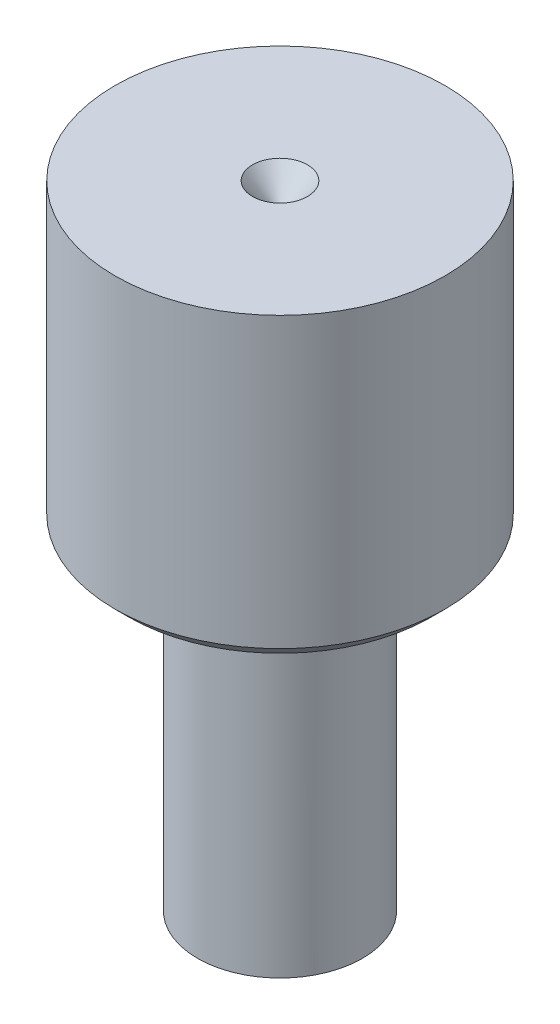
ISO-10303-21;
HEADER;
FILE_DESCRIPTION(('STEP AP214'),'2;1');
FILE_NAME('part.step','',(''),(''),'','','');
FILE_SCHEMA(('AUTOMOTIVE_DESIGN { 1 0 10303 214 1 1 1 1 }'));
ENDSEC;
DATA;
#1=APPLICATION_CONTEXT('core data for automotive mechanical design processes');
#2=APPLICATION_PROTOCOL_DEFINITION('international standard','automotive_design',2000,#1);
#3=PRODUCT_CONTEXT('',#1,'mechanical');
#4=PRODUCT('Part','Part','',(#3));
#5=PRODUCT_RELATED_PRODUCT_CATEGORY('part','',(#4));
#6=PRODUCT_DEFINITION_FORMATION('','',#4);
#7=PRODUCT_DEFINITION_CONTEXT('part definition',#1,'design');
#8=PRODUCT_DEFINITION('design','',#6,#7);
#9=PRODUCT_DEFINITION_SHAPE('','',#8);
#10=(LENGTH_UNIT() NAMED_UNIT(*) SI_UNIT(.MILLI.,.METRE.));
#11=(NAMED_UNIT(*) PLANE_ANGLE_UNIT() SI_UNIT($,.RADIAN.));
#12=(NAMED_UNIT(*) SI_UNIT($,.STERADIAN.) SOLID_ANGLE_UNIT());
#13=UNCERTAINTY_MEASURE_WITH_UNIT(LENGTH_MEASURE(1.E-05),#10,'distance_accuracy_value','');
#14=(GEOMETRIC_REPRESENTATION_CONTEXT(3) GLOBAL_UNCERTAINTY_ASSIGNED_CONTEXT((#13)) GLOBAL_UNIT_ASSIGNED_CONTEXT((#10,
#11,#12)) REPRESENTATION_CONTEXT('',''));
#15=CARTESIAN_POINT('',(0.,0.,0.));
#16=DIRECTION('',(0.,0.,1.));
#17=DIRECTION('',(1.,0.,0.));
#18=AXIS2_PLACEMENT_3D('',#15,#16,#17);
#19=CARTESIAN_POINT('',(0.,0.,0.));
#20=DIRECTION('',(0.,1.,0.));
#21=DIRECTION('',(0.,0.,1.));
#22=AXIS2_PLACEMENT_3D('',#19,#20,#21);
#23=PLANE('',#22);
#24=CARTESIAN_POINT('',(0.,0.,0.));
#25=DIRECTION('',(0.,1.,0.));
#26=DIRECTION('',(0.,0.,1.));
#27=AXIS2_PLACEMENT_3D('',#24,#25,#26);
#28=CIRCLE('',#27,3.4);
#29=CARTESIAN_POINT('',(0.,0.,3.4));
#30=VERTEX_POINT('',#29);
#31=EDGE_CURVE('E10',#30,#30,#28,.T.);
#32=ORIENTED_EDGE('',*,*,#31,.T.);
#33=EDGE_LOOP('',(#32));
#34=FACE_BOUND('',#33,.T.);
#35=CARTESIAN_POINT('',(0.,0.,0.));
#36=DIRECTION('',(0.,1.,0.));
#37=DIRECTION('',(0.,0.,1.));
#38=AXIS2_PLACEMENT_3D('',#35,#36,#37);
#39=CIRCLE('',#38,5.5);
#40=CARTESIAN_POINT('',(0.,0.,5.5));
#41=VERTEX_POINT('',#40);
#42=EDGE_CURVE('E41',#41,#41,#39,.F.);
#43=ORIENTED_EDGE('',*,*,#42,.T.);
#44=EDGE_LOOP('',(#43));
#45=FACE_BOUND('',#44,.T.);
#46=ADVANCED_FACE('F30',(#34,#45),#23,.F.);
#47=CARTESIAN_POINT('',(0.,11.,0.));
#48=DIRECTION('',(0.,-1.,0.));
#49=DIRECTION('',(0.,0.,-1.));
#50=AXIS2_PLACEMENT_3D('',#47,#48,#49);
#51=CYLINDRICAL_SURFACE('',#50,6.);
#52=CARTESIAN_POINT('',(0.,0.499999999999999,0.));
#53=DIRECTION('',(0.,1.,0.));
#54=DIRECTION('',(0.,0.,1.));
#55=AXIS2_PLACEMENT_3D('',#52,#53,#54);
#56=CIRCLE('',#55,6.);
#57=CARTESIAN_POINT('',(0.,0.499999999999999,6.));
#58=VERTEX_POINT('',#57);
#59=EDGE_CURVE('E45',#58,#58,#56,.T.);
#60=ORIENTED_EDGE('',*,*,#59,.T.);
#61=EDGE_LOOP('',(#60));
#62=FACE_BOUND('',#61,.T.);
#63=CARTESIAN_POINT('',(0.,11.,0.));
#64=DIRECTION('',(0.,1.,0.));
#65=DIRECTION('',(0.,0.,1.));
#66=AXIS2_PLACEMENT_3D('',#63,#64,#65);
#67=CIRCLE('',#66,6.);
#68=CARTESIAN_POINT('',(0.,11.,6.));
#69=VERTEX_POINT('',#68);
#70=EDGE_CURVE('E50',#69,#69,#67,.T.);
#71=ORIENTED_EDGE('',*,*,#70,.F.);
#72=EDGE_LOOP('',(#71));
#73=FACE_BOUND('',#72,.T.);
#74=ADVANCED_FACE('F32',(#62,#73),#51,.T.);
#75=CARTESIAN_POINT('',(0.,11.,0.));
#76=DIRECTION('',(0.,1.,0.));
#77=DIRECTION('',(0.,0.,1.));
#78=AXIS2_PLACEMENT_3D('',#75,#76,#77);
#79=PLANE('',#78);
#80=CARTESIAN_POINT('',(0.,11.,0.));
#81=DIRECTION('',(0.,1.,0.));
#82=DIRECTION('',(0.,0.,1.));
#83=AXIS2_PLACEMENT_3D('',#80,#81,#82);
#84=CIRCLE('',#83,1.);
#85=CARTESIAN_POINT('',(0.,11.,1.));
#86=VERTEX_POINT('',#85);
#87=EDGE_CURVE('E55',#86,#86,#84,.T.);
#88=ORIENTED_EDGE('',*,*,#87,.F.);
#89=EDGE_LOOP('',(#88));
#90=FACE_BOUND('',#89,.T.);
#91=ORIENTED_EDGE('',*,*,#70,.T.);
#92=EDGE_LOOP('',(#91));
#93=FACE_BOUND('',#92,.T.);
#94=ADVANCED_FACE('F69',(#90,#93),#79,.T.);
#95=CARTESIAN_POINT('',(0.,-12.,0.));
#96=DIRECTION('',(0.,1.,0.));
#97=DIRECTION('',(0.,0.,1.));
#98=AXIS2_PLACEMENT_3D('',#95,#96,#97);
#99=CYLINDRICAL_SURFACE('',#98,3.);
#100=CARTESIAN_POINT('',(0.,-0.399999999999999,0.));
#101=DIRECTION('',(0.,1.,0.));
#102=DIRECTION('',(0.,0.,1.));
#103=AXIS2_PLACEMENT_3D('',#100,#101,#102);
#104=CIRCLE('',#103,3.);
#105=CARTESIAN_POINT('',(0.,-0.399999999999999,3.));
#106=VERTEX_POINT('',#105);
#107=EDGE_CURVE('E37',#106,#106,#104,.F.);
#108=ORIENTED_EDGE('',*,*,#107,.T.);
#109=EDGE_LOOP('',(#108));
#110=FACE_BOUND('',#109,.T.);
#111=CARTESIAN_POINT('',(0.,-12.,0.));
#112=DIRECTION('',(0.,-1.,0.));
#113=DIRECTION('',(0.,0.,-1.));
#114=AXIS2_PLACEMENT_3D('',#111,#112,#113);
#115=CIRCLE('',#114,3.);
#116=CARTESIAN_POINT('',(0.,-12.,-3.));
#117=VERTEX_POINT('',#116);
#118=EDGE_CURVE('E58',#117,#117,#115,.T.);
#119=ORIENTED_EDGE('',*,*,#118,.F.);
#120=EDGE_LOOP('',(#119));
#121=FACE_BOUND('',#120,.T.);
#122=ADVANCED_FACE('F72',(#110,#121),#99,.T.);
#123=CARTESIAN_POINT('',(0.,-12.,0.));
#124=DIRECTION('',(0.,-1.,0.));
#125=DIRECTION('',(0.,0.,-1.));
#126=AXIS2_PLACEMENT_3D('',#123,#124,#125);
#127=PLANE('',#126);
#128=CARTESIAN_POINT('',(0.,-12.,0.));
#129=DIRECTION('',(0.,-1.,0.));
#130=DIRECTION('',(0.,0.,-1.));
#131=AXIS2_PLACEMENT_3D('',#128,#129,#130);
#132=CIRCLE('',#131,1.);
#133=CARTESIAN_POINT('',(0.,-12.,-1.));
#134=VERTEX_POINT('',#133);
#135=EDGE_CURVE('E54',#134,#134,#132,.T.);
#136=ORIENTED_EDGE('',*,*,#135,.F.);
#137=EDGE_LOOP('',(#136));
#138=FACE_BOUND('',#137,.T.);
#139=ORIENTED_EDGE('',*,*,#118,.T.);
#140=EDGE_LOOP('',(#139));
#141=FACE_BOUND('',#140,.T.);
#142=ADVANCED_FACE('F100',(#138,#141),#127,.T.);
#143=CARTESIAN_POINT('',(0.,-12.,0.));
#144=DIRECTION('',(0.,-1.,0.));
#145=DIRECTION('',(0.,0.,-1.));
#146=AXIS2_PLACEMENT_3D('',#143,#144,#145);
#147=CONICAL_SURFACE('',#146,1.,0.0349065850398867);
#148=CARTESIAN_POINT('',(0.,10.0810538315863,0.));
#149=DIRECTION('',(0.,1.,0.));
#150=DIRECTION('',(0.,0.,1.));
#151=AXIS2_PLACEMENT_3D('',#148,#149,#150);
#152=CIRCLE('',#151,0.2289126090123);
#153=CARTESIAN_POINT('',(0.,10.0810538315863,-0.2289126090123));
#154=VERTEX_POINT('',#153);
#155=EDGE_CURVE('E51',#154,#154,#152,.T.);
#156=CARTESIAN_POINT('',(0.,10.0810538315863,-0.2289126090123));
#157=CARTESIAN_POINT('',(0.,9.85104285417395,-0.236944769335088));
#158=CARTESIAN_POINT('',(0.,9.62103187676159,-0.244976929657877));
#159=CARTESIAN_POINT('',(0.,9.16100992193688,-0.261041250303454));
#160=CARTESIAN_POINT('',(0.,8.93099894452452,-0.269073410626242));
#161=CARTESIAN_POINT('',(0.,8.47097698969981,-0.28513773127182));
#162=CARTESIAN_POINT('',(0.,8.24096601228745,-0.293169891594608));
#163=CARTESIAN_POINT('',(0.,7.78094405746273,-0.309234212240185));
#164=CARTESIAN_POINT('',(0.,7.55093308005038,-0.317266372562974));
#165=CARTESIAN_POINT('',(0.,7.09091112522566,-0.333330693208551));
#166=CARTESIAN_POINT('',(0.,6.86090014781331,-0.341362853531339));
#167=CARTESIAN_POINT('',(0.,6.40087819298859,-0.357427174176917));
#168=CARTESIAN_POINT('',(0.,6.17086721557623,-0.365459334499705));
#169=CARTESIAN_POINT('',(0.,5.71084526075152,-0.381523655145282));
#170=CARTESIAN_POINT('',(0.,5.48083428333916,-0.389555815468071));
#171=CARTESIAN_POINT('',(0.,5.02081232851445,-0.405620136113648));
#172=CARTESIAN_POINT('',(0.,4.79080135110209,-0.413652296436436));
#173=CARTESIAN_POINT('',(0.,4.33077939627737,-0.429716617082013));
#174=CARTESIAN_POINT('',(0.,4.10076841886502,-0.437748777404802));
#175=CARTESIAN_POINT('',(0.,3.6407464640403,-0.453813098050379));
#176=CARTESIAN_POINT('',(0.,3.41073548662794,-0.461845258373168));
#177=CARTESIAN_POINT('',(0.,2.95071353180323,-0.477909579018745));
#178=CARTESIAN_POINT('',(0.,2.72070255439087,-0.485941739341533));
#179=CARTESIAN_POINT('',(0.,2.26068059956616,-0.50200605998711));
#180=CARTESIAN_POINT('',(0.,2.0306696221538,-0.510038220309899));
#181=CARTESIAN_POINT('',(0.,1.57064766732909,-0.526102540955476));
#182=CARTESIAN_POINT('',(0.,1.34063668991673,-0.534134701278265));
#183=CARTESIAN_POINT('',(0.,0.880614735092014,-0.550199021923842));
#184=CARTESIAN_POINT('',(0.,0.650603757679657,-0.55823118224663));
#185=CARTESIAN_POINT('',(0.,0.190581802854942,-0.574295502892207));
#186=CARTESIAN_POINT('',(0.,-0.0394291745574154,-0.582327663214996));
#187=CARTESIAN_POINT('',(0.,-0.49945112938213,-0.598391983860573));
#188=CARTESIAN_POINT('',(0.,-0.729462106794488,-0.606424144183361));
#189=CARTESIAN_POINT('',(0.,-1.1894840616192,-0.622488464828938));
#190=CARTESIAN_POINT('',(0.,-1.41949503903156,-0.630520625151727));
#191=CARTESIAN_POINT('',(0.,-1.87951699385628,-0.646584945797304));
#192=CARTESIAN_POINT('',(0.,-2.10952797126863,-0.654617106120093));
#193=CARTESIAN_POINT('',(0.,-2.56954992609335,-0.67068142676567));
#194=CARTESIAN_POINT('',(0.,-2.7995609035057,-0.678713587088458));
#195=CARTESIAN_POINT('',(0.,-3.25958285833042,-0.694777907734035));
#196=CARTESIAN_POINT('',(0.,-3.48959383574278,-0.702810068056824));
#197=CARTESIAN_POINT('',(0.,-3.94961579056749,-0.718874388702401));
#198=CARTESIAN_POINT('',(0.,-4.17962676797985,-0.726906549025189));
#199=CARTESIAN_POINT('',(0.,-4.63964872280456,-0.742970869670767));
#200=CARTESIAN_POINT('',(0.,-4.86965970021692,-0.751003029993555));
#201=CARTESIAN_POINT('',(0.,-5.32968165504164,-0.767067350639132));
#202=CARTESIAN_POINT('',(0.,-5.55969263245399,-0.775099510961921));
#203=CARTESIAN_POINT('',(0.,-6.01971458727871,-0.791163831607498));
#204=CARTESIAN_POINT('',(0.,-6.24972556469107,-0.799195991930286));
#205=CARTESIAN_POINT('',(0.,-6.70974751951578,-0.815260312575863));
#206=CARTESIAN_POINT('',(0.,-6.93975849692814,-0.823292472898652));
#207=CARTESIAN_POINT('',(0.,-7.39978045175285,-0.839356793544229));
#208=CARTESIAN_POINT('',(0.,-7.62979142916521,-0.847388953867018));
#209=CARTESIAN_POINT('',(0.,-8.08981338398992,-0.863453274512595));
#210=CARTESIAN_POINT('',(0.,-8.31982436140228,-0.871485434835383));
#211=CARTESIAN_POINT('',(0.,-8.779846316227,-0.88754975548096));
#212=CARTESIAN_POINT('',(0.,-9.00985729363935,-0.895581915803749));
#213=CARTESIAN_POINT('',(0.,-9.46987924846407,-0.911646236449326));
#214=CARTESIAN_POINT('',(0.,-9.69989022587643,-0.919678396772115));
#215=CARTESIAN_POINT('',(0.,-10.1599121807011,-0.935742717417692));
#216=CARTESIAN_POINT('',(0.,-10.3899231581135,-0.94377487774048));
#217=CARTESIAN_POINT('',(0.,-10.8499451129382,-0.959839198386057));
#218=CARTESIAN_POINT('',(0.,-11.0799560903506,-0.967871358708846));
#219=CARTESIAN_POINT('',(0.,-11.5399780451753,-0.983935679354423));
#220=CARTESIAN_POINT('',(0.,-11.7699890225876,-0.991967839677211));
#221=CARTESIAN_POINT('',(0.,-12.,-1.));
#222=B_SPLINE_CURVE_WITH_KNOTS('',3,(#156,#157,#158,#159,#160,#161,#162,#163,#164,#165,#166,
#167,#168,#169,#170,#171,#172,#173,#174,#175,#176,#177,#178,#179,#180,#181,#182,#183,#184,#185,
#186,#187,#188,#189,#190,#191,#192,#193,#194,#195,#196,#197,#198,#199,#200,#201,#202,#203,#204,
#205,#206,#207,#208,#209,#210,#211,#212,#213,#214,#215,#216,#217,#218,#219,#220,#221),
.UNSPECIFIED.,.F.,.F.,(4,2,2,2,2,2,2,2,2,2,2,2,2,2,2,2,2,2,2,2,2,2,2,2,2,2,2,2,2,2,2,2,4),(0.,
0.690453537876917,1.38090707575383,2.07136061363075,2.76181415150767,3.45226768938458,
4.1427212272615,4.83317476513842,5.52362830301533,6.21408184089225,6.90453537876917,
7.59498891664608,8.285442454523,8.97589599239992,9.66634953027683,10.3568030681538,
11.0472566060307,11.7377101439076,12.4281636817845,13.1186172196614,13.8090707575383,
14.4995242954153,15.1899778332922,15.8804313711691,16.570884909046,17.2613384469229,
17.9517919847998,18.6422455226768,19.3326990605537,20.0231525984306,20.7136061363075,
21.4040596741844,22.0945132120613),.UNSPECIFIED.);
#223=EDGE_CURVE('BSEAM94',#154,#134,#222,.T.);
#224=ORIENTED_EDGE('',*,*,#155,.T.);
#225=ORIENTED_EDGE('',*,*,#135,.T.);
#226=ORIENTED_EDGE('',*,*,#223,.T.);
#227=ORIENTED_EDGE('',*,*,#223,.F.);
#228=EDGE_LOOP('',(#224,#226,#225,#227));
#229=FACE_BOUND('',#228,.T.);
#230=ADVANCED_FACE('F94',(#229),#147,.F.);
#231=CARTESIAN_POINT('',(0.,11.,0.));
#232=DIRECTION('',(0.,1.,0.));
#233=DIRECTION('',(0.,0.,1.));
#234=AXIS2_PLACEMENT_3D('',#231,#232,#233);
#235=CONICAL_SURFACE('',#234,1.,0.698131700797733);
#236=ORIENTED_EDGE('',*,*,#87,.T.);
#237=EDGE_LOOP('',(#236));
#238=FACE_BOUND('',#237,.T.);
#239=ORIENTED_EDGE('',*,*,#155,.F.);
#240=EDGE_LOOP('',(#239));
#241=FACE_BOUND('',#240,.T.);
#242=ADVANCED_FACE('F66',(#238,#241),#235,.F.);
#243=CARTESIAN_POINT('',(0.,0.499999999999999,0.));
#244=DIRECTION('',(0.,1.,0.));
#245=DIRECTION('',(0.,0.,1.));
#246=AXIS2_PLACEMENT_3D('',#243,#244,#245);
#247=CONICAL_SURFACE('',#246,6.,0.785398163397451);
#248=ORIENTED_EDGE('',*,*,#42,.F.);
#249=EDGE_LOOP('',(#248));
#250=FACE_BOUND('',#249,.T.);
#251=ORIENTED_EDGE('',*,*,#59,.F.);
#252=EDGE_LOOP('',(#251));
#253=FACE_BOUND('',#252,.T.);
#254=ADVANCED_FACE('F83',(#250,#253),#247,.T.);
#255=CARTESIAN_POINT('',(0.,-0.399999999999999,0.));
#256=DIRECTION('',(0.,1.,0.));
#257=DIRECTION('',(0.,0.,1.));
#258=AXIS2_PLACEMENT_3D('',#255,#256,#257);
#259=TOROIDAL_SURFACE('',#258,3.4,0.4);
#260=ORIENTED_EDGE('',*,*,#31,.F.);
#261=EDGE_LOOP('',(#260));
#262=FACE_BOUND('',#261,.T.);
#263=ORIENTED_EDGE('',*,*,#107,.F.);
#264=EDGE_LOOP('',(#263));
#265=FACE_BOUND('',#264,.T.);
#266=ADVANCED_FACE('F85',(#262,#265),#259,.F.);
#267=CLOSED_SHELL('',(#46,#74,#94,#122,#142,#230,#242,#254,#266));
#268=MANIFOLD_SOLID_BREP('B2',#267);
#269=ADVANCED_BREP_SHAPE_REPRESENTATION('',(#18,#268),#14);
#270=SHAPE_DEFINITION_REPRESENTATION(#9,#269);
ENDSEC;
END-ISO-10303-21;
